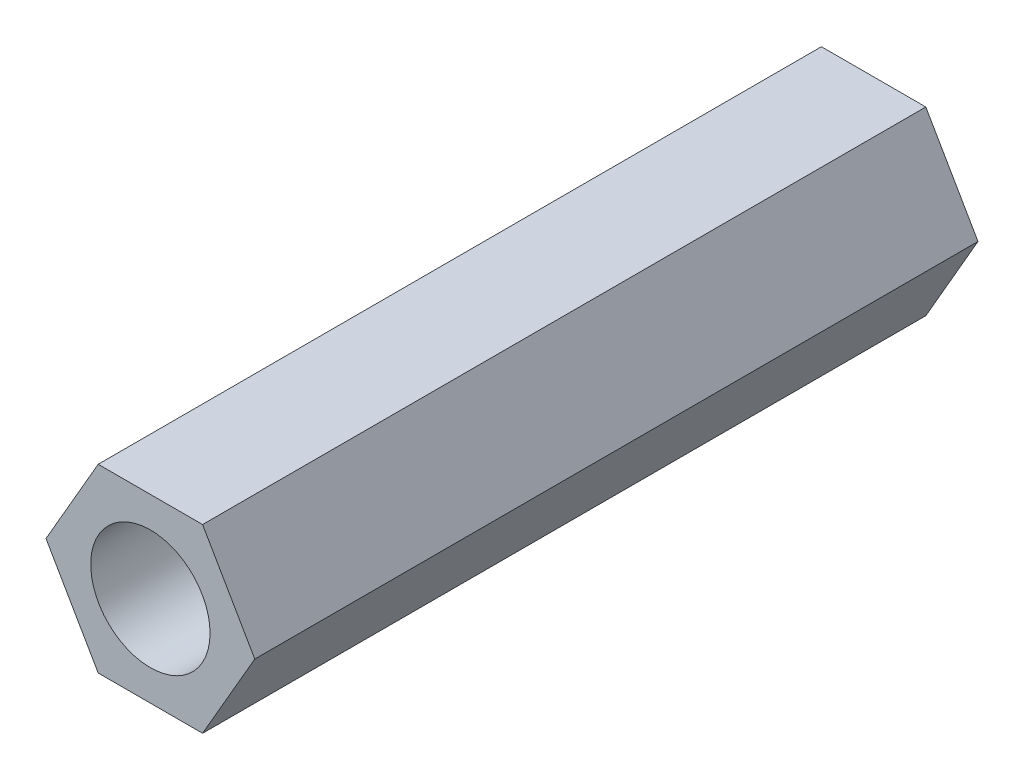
ISO-10303-21;
HEADER;
FILE_DESCRIPTION(('STEP AP214'),'2;1');
FILE_NAME('part.step','',(''),(''),'','','');
FILE_SCHEMA(('AUTOMOTIVE_DESIGN { 1 0 10303 214 1 1 1 1 }'));
ENDSEC;
DATA;
#1=APPLICATION_CONTEXT('core data for automotive mechanical design processes');
#2=APPLICATION_PROTOCOL_DEFINITION('international standard','automotive_design',2000,#1);
#3=PRODUCT_CONTEXT('',#1,'mechanical');
#4=PRODUCT('Part','Part','',(#3));
#5=PRODUCT_RELATED_PRODUCT_CATEGORY('part','',(#4));
#6=PRODUCT_DEFINITION_FORMATION('','',#4);
#7=PRODUCT_DEFINITION_CONTEXT('part definition',#1,'design');
#8=PRODUCT_DEFINITION('design','',#6,#7);
#9=PRODUCT_DEFINITION_SHAPE('','',#8);
#10=(LENGTH_UNIT() NAMED_UNIT(*) SI_UNIT(.MILLI.,.METRE.));
#11=(NAMED_UNIT(*) PLANE_ANGLE_UNIT() SI_UNIT($,.RADIAN.));
#12=(NAMED_UNIT(*) SI_UNIT($,.STERADIAN.) SOLID_ANGLE_UNIT());
#13=UNCERTAINTY_MEASURE_WITH_UNIT(LENGTH_MEASURE(1.E-05),#10,'distance_accuracy_value','');
#14=(GEOMETRIC_REPRESENTATION_CONTEXT(3) GLOBAL_UNCERTAINTY_ASSIGNED_CONTEXT((#13)) GLOBAL_UNIT_ASSIGNED_CONTEXT((#10,
#11,#12)) REPRESENTATION_CONTEXT('',''));
#15=CARTESIAN_POINT('',(0.,0.,0.));
#16=DIRECTION('',(0.,0.,1.));
#17=DIRECTION('',(1.,0.,0.));
#18=AXIS2_PLACEMENT_3D('',#15,#16,#17);
#19=CARTESIAN_POINT('',(-1.44337567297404,-2.5,20.));
#20=DIRECTION('',(0.,1.,0.));
#21=DIRECTION('',(1.,0.,0.));
#22=AXIS2_PLACEMENT_3D('',#19,#20,#21);
#23=PLANE('',#22);
#24=DIRECTION('',(1.,0.,0.));
#25=VECTOR('',#24,1.);
#26=CARTESIAN_POINT('',(-1.44337567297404,-2.5,0.));
#27=LINE('',#26,#25);
#28=CARTESIAN_POINT('',(-1.44337567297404,-2.5,0.));
#29=VERTEX_POINT('',#28);
#30=CARTESIAN_POINT('',(1.44337567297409,-2.5,0.));
#31=VERTEX_POINT('',#30);
#32=EDGE_CURVE('E93',#29,#31,#27,.T.);
#33=ORIENTED_EDGE('',*,*,#32,.T.);
#34=DIRECTION('',(0.,0.,-1.));
#35=VECTOR('',#34,1.);
#36=CARTESIAN_POINT('',(1.44337567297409,-2.5,20.));
#37=LINE('',#36,#35);
#38=CARTESIAN_POINT('',(1.44337567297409,-2.5,20.));
#39=VERTEX_POINT('',#38);
#40=EDGE_CURVE('E142',#39,#31,#37,.T.);
#41=ORIENTED_EDGE('',*,*,#40,.F.);
#42=DIRECTION('',(1.,0.,0.));
#43=VECTOR('',#42,1.);
#44=CARTESIAN_POINT('',(-1.44337567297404,-2.5,20.));
#45=LINE('',#44,#43);
#46=CARTESIAN_POINT('',(-1.44337567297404,-2.5,20.));
#47=VERTEX_POINT('',#46);
#48=EDGE_CURVE('E96',#47,#39,#45,.T.);
#49=ORIENTED_EDGE('',*,*,#48,.F.);
#50=DIRECTION('',(0.,0.,-1.));
#51=VECTOR('',#50,1.);
#52=CARTESIAN_POINT('',(-1.44337567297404,-2.5,20.));
#53=LINE('',#52,#51);
#54=EDGE_CURVE('E11',#47,#29,#53,.T.);
#55=ORIENTED_EDGE('',*,*,#54,.T.);
#56=EDGE_LOOP('',(#33,#41,#49,#55));
#57=FACE_BOUND('',#56,.T.);
#58=ADVANCED_FACE('F17',(#57),#23,.F.);
#59=CARTESIAN_POINT('',(-2.88675134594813,0.,20.));
#60=DIRECTION('',(0.866025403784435,0.500000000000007,0.));
#61=DIRECTION('',(0.,0.,-1.));
#62=AXIS2_PLACEMENT_3D('',#59,#60,#61);
#63=PLANE('',#62);
#64=DIRECTION('',(0.500000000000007,-0.866025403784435,0.));
#65=VECTOR('',#64,1.);
#66=CARTESIAN_POINT('',(-2.88675134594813,0.,0.));
#67=LINE('',#66,#65);
#68=CARTESIAN_POINT('',(-2.88675134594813,0.,0.));
#69=VERTEX_POINT('',#68);
#70=EDGE_CURVE('E101',#69,#29,#67,.T.);
#71=ORIENTED_EDGE('',*,*,#70,.T.);
#72=ORIENTED_EDGE('',*,*,#54,.F.);
#73=DIRECTION('',(0.500000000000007,-0.866025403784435,0.));
#74=VECTOR('',#73,1.);
#75=CARTESIAN_POINT('',(-2.88675134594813,0.,20.));
#76=LINE('',#75,#74);
#77=CARTESIAN_POINT('',(-2.88675134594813,0.,20.));
#78=VERTEX_POINT('',#77);
#79=EDGE_CURVE('E128',#78,#47,#76,.T.);
#80=ORIENTED_EDGE('',*,*,#79,.F.);
#81=DIRECTION('',(0.,0.,-1.));
#82=VECTOR('',#81,1.);
#83=CARTESIAN_POINT('',(-2.88675134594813,0.,20.));
#84=LINE('',#83,#82);
#85=EDGE_CURVE('E25',#78,#69,#84,.T.);
#86=ORIENTED_EDGE('',*,*,#85,.T.);
#87=EDGE_LOOP('',(#71,#72,#80,#86));
#88=FACE_BOUND('',#87,.T.);
#89=ADVANCED_FACE('F102',(#88),#63,.F.);
#90=CARTESIAN_POINT('',(-1.44337567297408,2.5,20.));
#91=DIRECTION('',(0.866025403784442,-0.5,0.));
#92=DIRECTION('',(0.,0.,-1.));
#93=AXIS2_PLACEMENT_3D('',#90,#91,#92);
#94=PLANE('',#93);
#95=DIRECTION('',(-0.5,-0.866025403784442,0.));
#96=VECTOR('',#95,1.);
#97=CARTESIAN_POINT('',(-1.44337567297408,2.5,0.));
#98=LINE('',#97,#96);
#99=CARTESIAN_POINT('',(-1.44337567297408,2.5,0.));
#100=VERTEX_POINT('',#99);
#101=EDGE_CURVE('E106',#100,#69,#98,.T.);
#102=ORIENTED_EDGE('',*,*,#101,.T.);
#103=ORIENTED_EDGE('',*,*,#85,.F.);
#104=DIRECTION('',(-0.5,-0.866025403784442,0.));
#105=VECTOR('',#104,1.);
#106=CARTESIAN_POINT('',(-1.44337567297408,2.5,20.));
#107=LINE('',#106,#105);
#108=CARTESIAN_POINT('',(-1.44337567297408,2.5,20.));
#109=VERTEX_POINT('',#108);
#110=EDGE_CURVE('E127',#109,#78,#107,.T.);
#111=ORIENTED_EDGE('',*,*,#110,.F.);
#112=DIRECTION('',(0.,0.,-1.));
#113=VECTOR('',#112,1.);
#114=CARTESIAN_POINT('',(-1.44337567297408,2.5,20.));
#115=LINE('',#114,#113);
#116=EDGE_CURVE('E49',#109,#100,#115,.T.);
#117=ORIENTED_EDGE('',*,*,#116,.T.);
#118=EDGE_LOOP('',(#102,#103,#111,#117));
#119=FACE_BOUND('',#118,.T.);
#120=ADVANCED_FACE('F289',(#119),#94,.F.);
#121=CARTESIAN_POINT('',(1.44337567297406,2.5,20.));
#122=DIRECTION('',(0.,-1.,0.));
#123=DIRECTION('',(0.,0.,-1.));
#124=AXIS2_PLACEMENT_3D('',#121,#122,#123);
#125=PLANE('',#124);
#126=DIRECTION('',(-1.,0.,0.));
#127=VECTOR('',#126,1.);
#128=CARTESIAN_POINT('',(1.44337567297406,2.5,0.));
#129=LINE('',#128,#127);
#130=CARTESIAN_POINT('',(1.44337567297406,2.5,0.));
#131=VERTEX_POINT('',#130);
#132=EDGE_CURVE('E133',#131,#100,#129,.T.);
#133=ORIENTED_EDGE('',*,*,#132,.T.);
#134=ORIENTED_EDGE('',*,*,#116,.F.);
#135=DIRECTION('',(-1.,0.,0.));
#136=VECTOR('',#135,1.);
#137=CARTESIAN_POINT('',(1.44337567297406,2.5,20.));
#138=LINE('',#137,#136);
#139=CARTESIAN_POINT('',(1.44337567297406,2.5,20.));
#140=VERTEX_POINT('',#139);
#141=EDGE_CURVE('E123',#140,#109,#138,.T.);
#142=ORIENTED_EDGE('',*,*,#141,.F.);
#143=DIRECTION('',(0.,0.,-1.));
#144=VECTOR('',#143,1.);
#145=CARTESIAN_POINT('',(1.44337567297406,2.5,20.));
#146=LINE('',#145,#144);
#147=EDGE_CURVE('E38',#140,#131,#146,.T.);
#148=ORIENTED_EDGE('',*,*,#147,.T.);
#149=EDGE_LOOP('',(#133,#134,#142,#148));
#150=FACE_BOUND('',#149,.T.);
#151=ADVANCED_FACE('F306',(#150),#125,.F.);
#152=CARTESIAN_POINT('',(2.88675134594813,0.,20.));
#153=DIRECTION('',(-0.866025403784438,-0.5,0.));
#154=DIRECTION('',(-0.5,0.866025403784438,0.));
#155=AXIS2_PLACEMENT_3D('',#152,#153,#154);
#156=PLANE('',#155);
#157=DIRECTION('',(-0.5,0.866025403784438,0.));
#158=VECTOR('',#157,1.);
#159=CARTESIAN_POINT('',(2.88675134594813,0.,0.));
#160=LINE('',#159,#158);
#161=CARTESIAN_POINT('',(2.88675134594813,0.,0.));
#162=VERTEX_POINT('',#161);
#163=EDGE_CURVE('E136',#162,#131,#160,.T.);
#164=ORIENTED_EDGE('',*,*,#163,.T.);
#165=ORIENTED_EDGE('',*,*,#147,.F.);
#166=DIRECTION('',(-0.5,0.866025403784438,0.));
#167=VECTOR('',#166,1.);
#168=CARTESIAN_POINT('',(2.88675134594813,0.,20.));
#169=LINE('',#168,#167);
#170=CARTESIAN_POINT('',(2.88675134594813,0.,20.));
#171=VERTEX_POINT('',#170);
#172=EDGE_CURVE('E121',#171,#140,#169,.T.);
#173=ORIENTED_EDGE('',*,*,#172,.F.);
#174=DIRECTION('',(0.,0.,-1.));
#175=VECTOR('',#174,1.);
#176=CARTESIAN_POINT('',(2.88675134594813,0.,20.));
#177=LINE('',#176,#175);
#178=EDGE_CURVE('E139',#171,#162,#177,.T.);
#179=ORIENTED_EDGE('',*,*,#178,.T.);
#180=EDGE_LOOP('',(#164,#165,#173,#179));
#181=FACE_BOUND('',#180,.T.);
#182=ADVANCED_FACE('F302',(#181),#156,.F.);
#183=CARTESIAN_POINT('',(1.44337567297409,-2.5,20.));
#184=DIRECTION('',(-0.866025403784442,0.5,0.));
#185=DIRECTION('',(0.,0.,1.));
#186=AXIS2_PLACEMENT_3D('',#183,#184,#185);
#187=PLANE('',#186);
#188=DIRECTION('',(0.5,0.866025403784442,0.));
#189=VECTOR('',#188,1.);
#190=CARTESIAN_POINT('',(1.44337567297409,-2.5,0.));
#191=LINE('',#190,#189);
#192=EDGE_CURVE('E111',#31,#162,#191,.T.);
#193=ORIENTED_EDGE('',*,*,#192,.T.);
#194=ORIENTED_EDGE('',*,*,#178,.F.);
#195=DIRECTION('',(0.5,0.866025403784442,0.));
#196=VECTOR('',#195,1.);
#197=CARTESIAN_POINT('',(1.44337567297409,-2.5,20.));
#198=LINE('',#197,#196);
#199=EDGE_CURVE('E216',#39,#171,#198,.T.);
#200=ORIENTED_EDGE('',*,*,#199,.F.);
#201=ORIENTED_EDGE('',*,*,#40,.T.);
#202=EDGE_LOOP('',(#193,#194,#200,#201));
#203=FACE_BOUND('',#202,.T.);
#204=ADVANCED_FACE('F272',(#203),#187,.F.);
#205=CARTESIAN_POINT('',(0.,0.,0.));
#206=DIRECTION('',(0.,0.,1.));
#207=DIRECTION('',(1.,0.,0.));
#208=AXIS2_PLACEMENT_3D('',#205,#206,#207);
#209=PLANE('',#208);
#210=CARTESIAN_POINT('',(0.,0.,0.));
#211=DIRECTION('',(0.,0.,1.));
#212=DIRECTION('',(1.,0.,0.));
#213=AXIS2_PLACEMENT_3D('',#210,#211,#212);
#214=CIRCLE('',#213,1.65);
#215=CARTESIAN_POINT('',(1.65,0.,0.));
#216=VERTEX_POINT('',#215);
#217=EDGE_CURVE('E206',#216,#216,#214,.T.);
#218=ORIENTED_EDGE('',*,*,#217,.T.);
#219=EDGE_LOOP('',(#218));
#220=FACE_BOUND('',#219,.T.);
#221=ORIENTED_EDGE('',*,*,#192,.F.);
#222=ORIENTED_EDGE('',*,*,#32,.F.);
#223=ORIENTED_EDGE('',*,*,#70,.F.);
#224=ORIENTED_EDGE('',*,*,#101,.F.);
#225=ORIENTED_EDGE('',*,*,#132,.F.);
#226=ORIENTED_EDGE('',*,*,#163,.F.);
#227=EDGE_LOOP('',(#221,#222,#223,#224,#225,#226));
#228=FACE_BOUND('',#227,.T.);
#229=ADVANCED_FACE('F108',(#220,#228),#209,.F.);
#230=CARTESIAN_POINT('',(0.,0.,20.));
#231=DIRECTION('',(0.,0.,1.));
#232=DIRECTION('',(1.,0.,0.));
#233=AXIS2_PLACEMENT_3D('',#230,#231,#232);
#234=PLANE('',#233);
#235=CARTESIAN_POINT('',(0.,0.,20.));
#236=DIRECTION('',(0.,0.,1.));
#237=DIRECTION('',(1.,0.,0.));
#238=AXIS2_PLACEMENT_3D('',#235,#236,#237);
#239=CIRCLE('',#238,1.65);
#240=CARTESIAN_POINT('',(1.65,0.,20.));
#241=VERTEX_POINT('',#240);
#242=EDGE_CURVE('E201',#241,#241,#239,.T.);
#243=ORIENTED_EDGE('',*,*,#242,.F.);
#244=EDGE_LOOP('',(#243));
#245=FACE_BOUND('',#244,.T.);
#246=ORIENTED_EDGE('',*,*,#199,.T.);
#247=ORIENTED_EDGE('',*,*,#172,.T.);
#248=ORIENTED_EDGE('',*,*,#141,.T.);
#249=ORIENTED_EDGE('',*,*,#110,.T.);
#250=ORIENTED_EDGE('',*,*,#79,.T.);
#251=ORIENTED_EDGE('',*,*,#48,.T.);
#252=EDGE_LOOP('',(#246,#247,#248,#249,#250,#251));
#253=FACE_BOUND('',#252,.T.);
#254=ADVANCED_FACE('F271',(#245,#253),#234,.T.);
#255=CARTESIAN_POINT('',(0.,0.,20.));
#256=DIRECTION('',(0.,0.,-1.));
#257=DIRECTION('',(-1.,0.,0.));
#258=AXIS2_PLACEMENT_3D('',#255,#256,#257);
#259=CYLINDRICAL_SURFACE('',#258,1.65);
#260=ORIENTED_EDGE('',*,*,#217,.F.);
#261=EDGE_LOOP('',(#260));
#262=FACE_BOUND('',#261,.T.);
#263=ORIENTED_EDGE('',*,*,#242,.T.);
#264=EDGE_LOOP('',(#263));
#265=FACE_BOUND('',#264,.T.);
#266=ADVANCED_FACE('F278',(#262,#265),#259,.F.);
#267=CLOSED_SHELL('',(#58,#89,#120,#151,#182,#204,#229,#254,#266));
#268=MANIFOLD_SOLID_BREP('B1',#267);
#269=ADVANCED_BREP_SHAPE_REPRESENTATION('',(#18,#268),#14);
#270=SHAPE_DEFINITION_REPRESENTATION(#9,#269);
ENDSEC;
END-ISO-10303-21;
